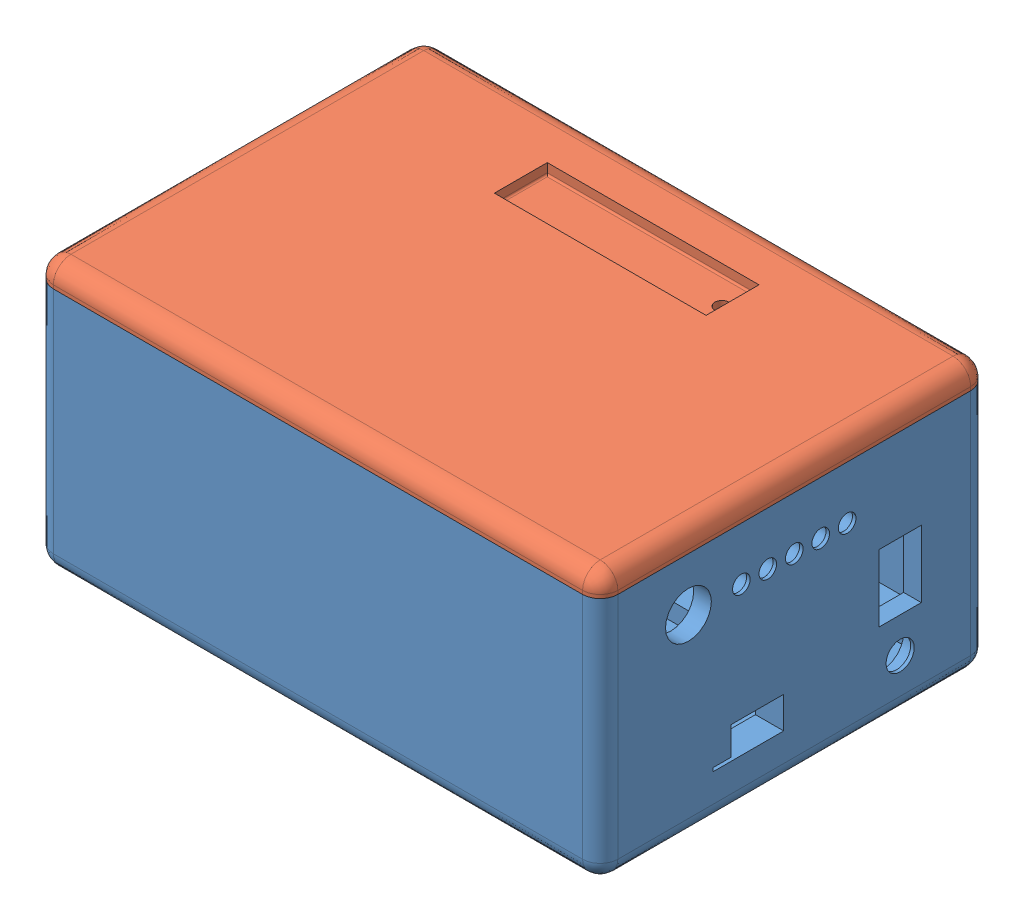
SolidWorks assembly Assembly_Final.SLDASM, configuration Default (file format 13000). Lengths in mm.
Overall size (160 76 110).
2 component instances, 2 part files, 3 mates.
Components (placement in the parent):
- Final-1: Final.SLDPRT [Default] at (85.6623 58.1426 126.3515) size (160 70 110)
- Final2-1: Final2.SLDPRT [Default] at (85.6623 123.1426 126.3515) size (160 11 110)
Mates (geometry in assembly coordinates):
- Distance1: distance = 0.5 mm anti-aligned: plane of Final2-1 through (11.1623 118.1426 175.8515) normal (0 0 1); plane of Final-1 through (10.6623 123.1426 176.3515) normal (0 0 -1)
- Distance2: distance = 0.5 mm anti-aligned: plane of Final2-1 through (160.1623 118.1426 175.8515) normal (1 0 0); plane of Final-1 through (160.6623 123.1426 76.3515) normal (-1 0 0)
- Coincident4: coincident anti-aligned: plane of Final-1 through (85.6623 123.1426 126.3515) normal (0 1 0); plane of Final2-1 through (85.6623 123.1426 126.3515) normal (0 -1 0)
